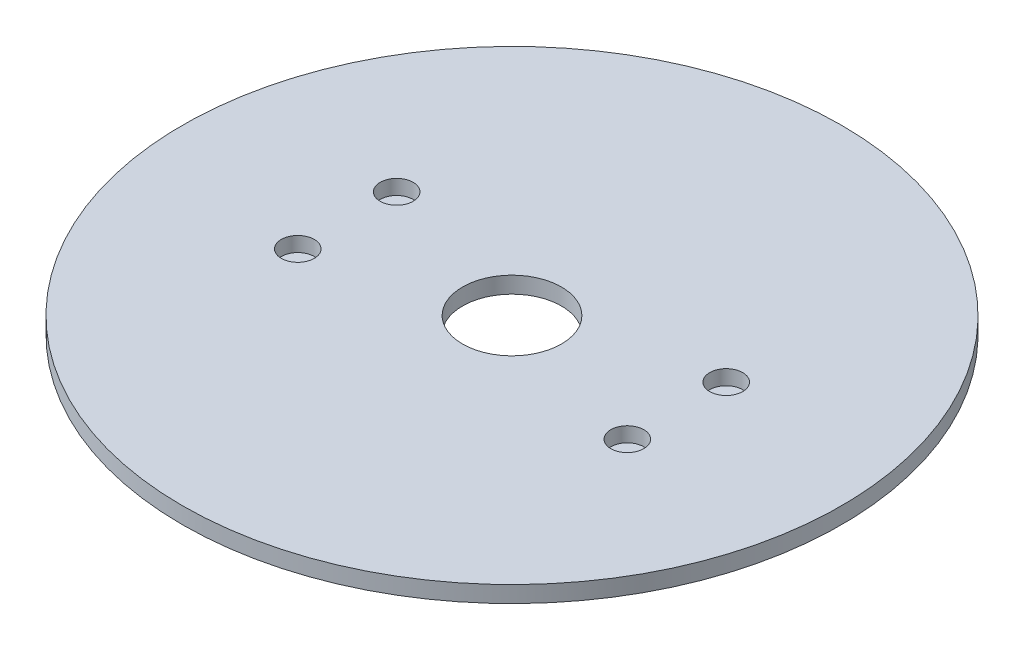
ISO-10303-21;
HEADER;
FILE_DESCRIPTION(('STEP AP214'),'2;1');
FILE_NAME('part.step','',(''),(''),'','','');
FILE_SCHEMA(('AUTOMOTIVE_DESIGN { 1 0 10303 214 1 1 1 1 }'));
ENDSEC;
DATA;
#1=APPLICATION_CONTEXT('core data for automotive mechanical design processes');
#2=APPLICATION_PROTOCOL_DEFINITION('international standard','automotive_design',2000,#1);
#3=PRODUCT_CONTEXT('',#1,'mechanical');
#4=PRODUCT('Part','Part','',(#3));
#5=PRODUCT_RELATED_PRODUCT_CATEGORY('part','',(#4));
#6=PRODUCT_DEFINITION_FORMATION('','',#4);
#7=PRODUCT_DEFINITION_CONTEXT('part definition',#1,'design');
#8=PRODUCT_DEFINITION('design','',#6,#7);
#9=PRODUCT_DEFINITION_SHAPE('','',#8);
#10=(LENGTH_UNIT() NAMED_UNIT(*) SI_UNIT(.MILLI.,.METRE.));
#11=(NAMED_UNIT(*) PLANE_ANGLE_UNIT() SI_UNIT($,.RADIAN.));
#12=(NAMED_UNIT(*) SI_UNIT($,.STERADIAN.) SOLID_ANGLE_UNIT());
#13=UNCERTAINTY_MEASURE_WITH_UNIT(LENGTH_MEASURE(1.E-05),#10,'distance_accuracy_value','');
#14=(GEOMETRIC_REPRESENTATION_CONTEXT(3) GLOBAL_UNCERTAINTY_ASSIGNED_CONTEXT((#13)) GLOBAL_UNIT_ASSIGNED_CONTEXT((#10,
#11,#12)) REPRESENTATION_CONTEXT('',''));
#15=CARTESIAN_POINT('',(0.,0.,0.));
#16=DIRECTION('',(0.,0.,1.));
#17=DIRECTION('',(1.,0.,0.));
#18=AXIS2_PLACEMENT_3D('',#15,#16,#17);
#19=CARTESIAN_POINT('',(0.,50.,0.));
#20=DIRECTION('',(0.,-1.,0.));
#21=DIRECTION('',(0.,0.,-1.));
#22=AXIS2_PLACEMENT_3D('',#19,#20,#21);
#23=CYLINDRICAL_SURFACE('',#22,1000.);
#24=CARTESIAN_POINT('',(0.,50.,0.));
#25=DIRECTION('',(0.,1.,0.));
#26=DIRECTION('',(0.,0.,1.));
#27=AXIS2_PLACEMENT_3D('',#24,#25,#26);
#28=CIRCLE('',#27,1000.);
#29=CARTESIAN_POINT('',(0.,50.,1000.));
#30=VERTEX_POINT('',#29);
#31=EDGE_CURVE('E10',#30,#30,#28,.T.);
#32=ORIENTED_EDGE('',*,*,#31,.F.);
#33=EDGE_LOOP('',(#32));
#34=FACE_BOUND('',#33,.T.);
#35=CARTESIAN_POINT('',(0.,0.,0.));
#36=DIRECTION('',(0.,1.,0.));
#37=DIRECTION('',(0.,0.,1.));
#38=AXIS2_PLACEMENT_3D('',#35,#36,#37);
#39=CIRCLE('',#38,1000.);
#40=CARTESIAN_POINT('',(0.,0.,1000.));
#41=VERTEX_POINT('',#40);
#42=EDGE_CURVE('E37',#41,#41,#39,.T.);
#43=ORIENTED_EDGE('',*,*,#42,.T.);
#44=EDGE_LOOP('',(#43));
#45=FACE_BOUND('',#44,.T.);
#46=ADVANCED_FACE('F34',(#34,#45),#23,.T.);
#47=CARTESIAN_POINT('',(0.,50.,0.));
#48=DIRECTION('',(0.,1.,0.));
#49=DIRECTION('',(0.,0.,1.));
#50=AXIS2_PLACEMENT_3D('',#47,#48,#49);
#51=PLANE('',#50);
#52=CARTESIAN_POINT('',(0.,50.,0.));
#53=DIRECTION('',(0.,1.,0.));
#54=DIRECTION('',(0.,0.,1.));
#55=AXIS2_PLACEMENT_3D('',#52,#53,#54);
#56=CIRCLE('',#55,150.);
#57=CARTESIAN_POINT('',(0.,50.,150.));
#58=VERTEX_POINT('',#57);
#59=EDGE_CURVE('E70',#58,#58,#56,.T.);
#60=ORIENTED_EDGE('',*,*,#59,.F.);
#61=EDGE_LOOP('',(#60));
#62=FACE_BOUND('',#61,.T.);
#63=CARTESIAN_POINT('',(-500.,50.,-150.));
#64=DIRECTION('',(0.,1.,0.));
#65=DIRECTION('',(0.,0.,1.));
#66=AXIS2_PLACEMENT_3D('',#63,#64,#65);
#67=CIRCLE('',#66,50.0000000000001);
#68=CARTESIAN_POINT('',(-500.,50.,-99.9999999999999));
#69=VERTEX_POINT('',#68);
#70=EDGE_CURVE('E65',#69,#69,#67,.T.);
#71=ORIENTED_EDGE('',*,*,#70,.F.);
#72=EDGE_LOOP('',(#71));
#73=FACE_BOUND('',#72,.T.);
#74=CARTESIAN_POINT('',(-500.,50.,150.));
#75=DIRECTION('',(0.,1.,0.));
#76=DIRECTION('',(0.,0.,1.));
#77=AXIS2_PLACEMENT_3D('',#74,#75,#76);
#78=CIRCLE('',#77,50.0000000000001);
#79=CARTESIAN_POINT('',(-500.,50.,200.));
#80=VERTEX_POINT('',#79);
#81=EDGE_CURVE('E58',#80,#80,#78,.T.);
#82=ORIENTED_EDGE('',*,*,#81,.F.);
#83=EDGE_LOOP('',(#82));
#84=FACE_BOUND('',#83,.T.);
#85=CARTESIAN_POINT('',(500.,50.,150.));
#86=DIRECTION('',(0.,1.,0.));
#87=DIRECTION('',(0.,0.,1.));
#88=AXIS2_PLACEMENT_3D('',#85,#86,#87);
#89=CIRCLE('',#88,50.);
#90=CARTESIAN_POINT('',(500.,50.,200.));
#91=VERTEX_POINT('',#90);
#92=EDGE_CURVE('E52',#91,#91,#89,.T.);
#93=ORIENTED_EDGE('',*,*,#92,.F.);
#94=EDGE_LOOP('',(#93));
#95=FACE_BOUND('',#94,.T.);
#96=CARTESIAN_POINT('',(500.,50.,-150.));
#97=DIRECTION('',(0.,1.,0.));
#98=DIRECTION('',(0.,0.,1.));
#99=AXIS2_PLACEMENT_3D('',#96,#97,#98);
#100=CIRCLE('',#99,50.);
#101=CARTESIAN_POINT('',(500.,50.,-100.));
#102=VERTEX_POINT('',#101);
#103=EDGE_CURVE('E46',#102,#102,#100,.T.);
#104=ORIENTED_EDGE('',*,*,#103,.F.);
#105=EDGE_LOOP('',(#104));
#106=FACE_BOUND('',#105,.T.);
#107=ORIENTED_EDGE('',*,*,#31,.T.);
#108=EDGE_LOOP('',(#107));
#109=FACE_BOUND('',#108,.T.);
#110=ADVANCED_FACE('F86',(#62,#73,#84,#95,#106,#109),#51,.T.);
#111=CARTESIAN_POINT('',(0.,0.,0.));
#112=DIRECTION('',(0.,1.,0.));
#113=DIRECTION('',(0.,0.,1.));
#114=AXIS2_PLACEMENT_3D('',#111,#112,#113);
#115=PLANE('',#114);
#116=CARTESIAN_POINT('',(0.,0.,0.));
#117=DIRECTION('',(0.,1.,0.));
#118=DIRECTION('',(0.,0.,1.));
#119=AXIS2_PLACEMENT_3D('',#116,#117,#118);
#120=CIRCLE('',#119,150.);
#121=CARTESIAN_POINT('',(0.,0.,150.));
#122=VERTEX_POINT('',#121);
#123=EDGE_CURVE('E62',#122,#122,#120,.T.);
#124=ORIENTED_EDGE('',*,*,#123,.T.);
#125=EDGE_LOOP('',(#124));
#126=FACE_BOUND('',#125,.T.);
#127=ORIENTED_EDGE('',*,*,#42,.F.);
#128=EDGE_LOOP('',(#127));
#129=FACE_BOUND('',#128,.T.);
#130=ADVANCED_FACE('F76',(#126,#129),#115,.F.);
#131=CARTESIAN_POINT('',(500.,5.,-150.));
#132=DIRECTION('',(0.,1.,0.));
#133=DIRECTION('',(0.,0.,1.));
#134=AXIS2_PLACEMENT_3D('',#131,#132,#133);
#135=CYLINDRICAL_SURFACE('',#134,50.);
#136=CARTESIAN_POINT('',(500.,5.,-150.));
#137=DIRECTION('',(0.,1.,0.));
#138=DIRECTION('',(0.,0.,1.));
#139=AXIS2_PLACEMENT_3D('',#136,#137,#138);
#140=CIRCLE('',#139,50.);
#141=CARTESIAN_POINT('',(500.,5.,-100.));
#142=VERTEX_POINT('',#141);
#143=EDGE_CURVE('E44',#142,#142,#140,.T.);
#144=CARTESIAN_POINT('',(500.,5.,-100.));
#145=CARTESIAN_POINT('',(500.,5.46875,-100.));
#146=CARTESIAN_POINT('',(500.,5.9375,-100.));
#147=CARTESIAN_POINT('',(500.,6.875,-100.));
#148=CARTESIAN_POINT('',(500.,7.34375,-100.));
#149=CARTESIAN_POINT('',(500.,8.28125,-100.));
#150=CARTESIAN_POINT('',(500.,8.75,-100.));
#151=CARTESIAN_POINT('',(500.,9.6875,-100.));
#152=CARTESIAN_POINT('',(500.,10.15625,-100.));
#153=CARTESIAN_POINT('',(500.,11.09375,-100.));
#154=CARTESIAN_POINT('',(500.,11.5625,-100.));
#155=CARTESIAN_POINT('',(500.,12.5,-100.));
#156=CARTESIAN_POINT('',(500.,12.96875,-100.));
#157=CARTESIAN_POINT('',(500.,13.90625,-100.));
#158=CARTESIAN_POINT('',(500.,14.375,-100.));
#159=CARTESIAN_POINT('',(500.,15.3125,-100.));
#160=CARTESIAN_POINT('',(500.,15.78125,-100.));
#161=CARTESIAN_POINT('',(500.,16.71875,-100.));
#162=CARTESIAN_POINT('',(500.,17.1875,-100.));
#163=CARTESIAN_POINT('',(500.,18.125,-100.));
#164=CARTESIAN_POINT('',(500.,18.59375,-100.));
#165=CARTESIAN_POINT('',(500.,19.53125,-100.));
#166=CARTESIAN_POINT('',(500.,20.,-100.));
#167=CARTESIAN_POINT('',(500.,20.9375,-100.));
#168=CARTESIAN_POINT('',(500.,21.40625,-100.));
#169=CARTESIAN_POINT('',(500.,22.34375,-100.));
#170=CARTESIAN_POINT('',(500.,22.8125,-100.));
#171=CARTESIAN_POINT('',(500.,23.75,-100.));
#172=CARTESIAN_POINT('',(500.,24.21875,-100.));
#173=CARTESIAN_POINT('',(500.,25.15625,-100.));
#174=CARTESIAN_POINT('',(500.,25.625,-100.));
#175=CARTESIAN_POINT('',(500.,26.5625,-100.));
#176=CARTESIAN_POINT('',(500.,27.03125,-100.));
#177=CARTESIAN_POINT('',(500.,27.96875,-100.));
#178=CARTESIAN_POINT('',(500.,28.4375,-100.));
#179=CARTESIAN_POINT('',(500.,29.375,-100.));
#180=CARTESIAN_POINT('',(500.,29.84375,-100.));
#181=CARTESIAN_POINT('',(500.,30.78125,-100.));
#182=CARTESIAN_POINT('',(500.,31.25,-100.));
#183=CARTESIAN_POINT('',(500.,32.1875,-100.));
#184=CARTESIAN_POINT('',(500.,32.65625,-100.));
#185=CARTESIAN_POINT('',(500.,33.59375,-100.));
#186=CARTESIAN_POINT('',(500.,34.0625,-100.));
#187=CARTESIAN_POINT('',(500.,35.,-100.));
#188=CARTESIAN_POINT('',(500.,35.46875,-100.));
#189=CARTESIAN_POINT('',(500.,36.40625,-100.));
#190=CARTESIAN_POINT('',(500.,36.875,-100.));
#191=CARTESIAN_POINT('',(500.,37.8125,-100.));
#192=CARTESIAN_POINT('',(500.,38.28125,-100.));
#193=CARTESIAN_POINT('',(500.,39.21875,-100.));
#194=CARTESIAN_POINT('',(500.,39.6875,-100.));
#195=CARTESIAN_POINT('',(500.,40.625,-100.));
#196=CARTESIAN_POINT('',(500.,41.09375,-100.));
#197=CARTESIAN_POINT('',(500.,42.03125,-100.));
#198=CARTESIAN_POINT('',(500.,42.5,-100.));
#199=CARTESIAN_POINT('',(500.,43.4375,-100.));
#200=CARTESIAN_POINT('',(500.,43.90625,-100.));
#201=CARTESIAN_POINT('',(500.,44.84375,-100.));
#202=CARTESIAN_POINT('',(500.,45.3125,-100.));
#203=CARTESIAN_POINT('',(500.,46.25,-100.));
#204=CARTESIAN_POINT('',(500.,46.71875,-100.));
#205=CARTESIAN_POINT('',(500.,47.65625,-100.));
#206=CARTESIAN_POINT('',(500.,48.125,-100.));
#207=CARTESIAN_POINT('',(500.,49.0625,-100.));
#208=CARTESIAN_POINT('',(500.,49.53125,-100.));
#209=CARTESIAN_POINT('',(500.,50.,-100.));
#210=B_SPLINE_CURVE_WITH_KNOTS('',3,(#144,#145,#146,#147,#148,#149,#150,#151,#152,#153,#154,
#155,#156,#157,#158,#159,#160,#161,#162,#163,#164,#165,#166,#167,#168,#169,#170,#171,#172,#173,
#174,#175,#176,#177,#178,#179,#180,#181,#182,#183,#184,#185,#186,#187,#188,#189,#190,#191,#192,
#193,#194,#195,#196,#197,#198,#199,#200,#201,#202,#203,#204,#205,#206,#207,#208,#209),
.UNSPECIFIED.,.F.,.F.,(4,2,2,2,2,2,2,2,2,2,2,2,2,2,2,2,2,2,2,2,2,2,2,2,2,2,2,2,2,2,2,2,4),(0.,
1.40625,2.8125,4.21875,5.625,7.03125,8.4375,9.84375,11.25,12.65625,14.0625,15.46875,16.875,
18.28125,19.6875,21.09375,22.5,23.90625,25.3125,26.71875,28.125,29.53125,30.9375,32.34375,33.75,
35.15625,36.5625,37.96875,39.375,40.78125,42.1875,43.59375,45.),.UNSPECIFIED.);
#211=EDGE_CURVE('BSEAM98',#142,#102,#210,.T.);
#212=ORIENTED_EDGE('',*,*,#143,.F.);
#213=ORIENTED_EDGE('',*,*,#103,.T.);
#214=ORIENTED_EDGE('',*,*,#211,.T.);
#215=ORIENTED_EDGE('',*,*,#211,.F.);
#216=EDGE_LOOP('',(#212,#214,#213,#215));
#217=FACE_BOUND('',#216,.T.);
#218=ADVANCED_FACE('F98',(#217),#135,.F.);
#219=CARTESIAN_POINT('',(500.,5.,-150.));
#220=DIRECTION('',(0.,1.,0.));
#221=DIRECTION('',(0.,0.,1.));
#222=AXIS2_PLACEMENT_3D('',#219,#220,#221);
#223=PLANE('',#222);
#224=ORIENTED_EDGE('',*,*,#143,.T.);
#225=EDGE_LOOP('',(#224));
#226=FACE_BOUND('',#225,.T.);
#227=ADVANCED_FACE('F100',(#226),#223,.T.);
#228=CARTESIAN_POINT('',(500.,5.,150.));
#229=DIRECTION('',(0.,1.,0.));
#230=DIRECTION('',(0.,0.,1.));
#231=AXIS2_PLACEMENT_3D('',#228,#229,#230);
#232=CYLINDRICAL_SURFACE('',#231,50.);
#233=CARTESIAN_POINT('',(500.,5.,150.));
#234=DIRECTION('',(0.,1.,0.));
#235=DIRECTION('',(0.,0.,1.));
#236=AXIS2_PLACEMENT_3D('',#233,#234,#235);
#237=CIRCLE('',#236,50.);
#238=CARTESIAN_POINT('',(500.,5.,200.));
#239=VERTEX_POINT('',#238);
#240=EDGE_CURVE('E49',#239,#239,#237,.T.);
#241=CARTESIAN_POINT('',(500.,5.,200.));
#242=CARTESIAN_POINT('',(500.,5.46875,200.));
#243=CARTESIAN_POINT('',(500.,5.9375,200.));
#244=CARTESIAN_POINT('',(500.,6.875,200.));
#245=CARTESIAN_POINT('',(500.,7.34375,200.));
#246=CARTESIAN_POINT('',(500.,8.28125,200.));
#247=CARTESIAN_POINT('',(500.,8.75,200.));
#248=CARTESIAN_POINT('',(500.,9.6875,200.));
#249=CARTESIAN_POINT('',(500.,10.15625,200.));
#250=CARTESIAN_POINT('',(500.,11.09375,200.));
#251=CARTESIAN_POINT('',(500.,11.5625,200.));
#252=CARTESIAN_POINT('',(500.,12.5,200.));
#253=CARTESIAN_POINT('',(500.,12.96875,200.));
#254=CARTESIAN_POINT('',(500.,13.90625,200.));
#255=CARTESIAN_POINT('',(500.,14.375,200.));
#256=CARTESIAN_POINT('',(500.,15.3125,200.));
#257=CARTESIAN_POINT('',(500.,15.78125,200.));
#258=CARTESIAN_POINT('',(500.,16.71875,200.));
#259=CARTESIAN_POINT('',(500.,17.1875,200.));
#260=CARTESIAN_POINT('',(500.,18.125,200.));
#261=CARTESIAN_POINT('',(500.,18.59375,200.));
#262=CARTESIAN_POINT('',(500.,19.53125,200.));
#263=CARTESIAN_POINT('',(500.,20.,200.));
#264=CARTESIAN_POINT('',(500.,20.9375,200.));
#265=CARTESIAN_POINT('',(500.,21.40625,200.));
#266=CARTESIAN_POINT('',(500.,22.34375,200.));
#267=CARTESIAN_POINT('',(500.,22.8125,200.));
#268=CARTESIAN_POINT('',(500.,23.75,200.));
#269=CARTESIAN_POINT('',(500.,24.21875,200.));
#270=CARTESIAN_POINT('',(500.,25.15625,200.));
#271=CARTESIAN_POINT('',(500.,25.625,200.));
#272=CARTESIAN_POINT('',(500.,26.5625,200.));
#273=CARTESIAN_POINT('',(500.,27.03125,200.));
#274=CARTESIAN_POINT('',(500.,27.96875,200.));
#275=CARTESIAN_POINT('',(500.,28.4375,200.));
#276=CARTESIAN_POINT('',(500.,29.375,200.));
#277=CARTESIAN_POINT('',(500.,29.84375,200.));
#278=CARTESIAN_POINT('',(500.,30.78125,200.));
#279=CARTESIAN_POINT('',(500.,31.25,200.));
#280=CARTESIAN_POINT('',(500.,32.1875,200.));
#281=CARTESIAN_POINT('',(500.,32.65625,200.));
#282=CARTESIAN_POINT('',(500.,33.59375,200.));
#283=CARTESIAN_POINT('',(500.,34.0625,200.));
#284=CARTESIAN_POINT('',(500.,35.,200.));
#285=CARTESIAN_POINT('',(500.,35.46875,200.));
#286=CARTESIAN_POINT('',(500.,36.40625,200.));
#287=CARTESIAN_POINT('',(500.,36.875,200.));
#288=CARTESIAN_POINT('',(500.,37.8125,200.));
#289=CARTESIAN_POINT('',(500.,38.28125,200.));
#290=CARTESIAN_POINT('',(500.,39.21875,200.));
#291=CARTESIAN_POINT('',(500.,39.6875,200.));
#292=CARTESIAN_POINT('',(500.,40.625,200.));
#293=CARTESIAN_POINT('',(500.,41.09375,200.));
#294=CARTESIAN_POINT('',(500.,42.03125,200.));
#295=CARTESIAN_POINT('',(500.,42.5,200.));
#296=CARTESIAN_POINT('',(500.,43.4375,200.));
#297=CARTESIAN_POINT('',(500.,43.90625,200.));
#298=CARTESIAN_POINT('',(500.,44.84375,200.));
#299=CARTESIAN_POINT('',(500.,45.3125,200.));
#300=CARTESIAN_POINT('',(500.,46.25,200.));
#301=CARTESIAN_POINT('',(500.,46.71875,200.));
#302=CARTESIAN_POINT('',(500.,47.65625,200.));
#303=CARTESIAN_POINT('',(500.,48.125,200.));
#304=CARTESIAN_POINT('',(500.,49.0625,200.));
#305=CARTESIAN_POINT('',(500.,49.53125,200.));
#306=CARTESIAN_POINT('',(500.,50.,200.));
#307=B_SPLINE_CURVE_WITH_KNOTS('',3,(#241,#242,#243,#244,#245,#246,#247,#248,#249,#250,#251,
#252,#253,#254,#255,#256,#257,#258,#259,#260,#261,#262,#263,#264,#265,#266,#267,#268,#269,#270,
#271,#272,#273,#274,#275,#276,#277,#278,#279,#280,#281,#282,#283,#284,#285,#286,#287,#288,#289,
#290,#291,#292,#293,#294,#295,#296,#297,#298,#299,#300,#301,#302,#303,#304,#305,#306),
.UNSPECIFIED.,.F.,.F.,(4,2,2,2,2,2,2,2,2,2,2,2,2,2,2,2,2,2,2,2,2,2,2,2,2,2,2,2,2,2,2,2,4),(0.,
1.40625,2.8125,4.21875,5.625,7.03125,8.4375,9.84375,11.25,12.65625,14.0625,15.46875,16.875,
18.28125,19.6875,21.09375,22.5,23.90625,25.3125,26.71875,28.125,29.53125,30.9375,32.34375,33.75,
35.15625,36.5625,37.96875,39.375,40.78125,42.1875,43.59375,45.),.UNSPECIFIED.);
#308=EDGE_CURVE('BSEAM107',#239,#91,#307,.T.);
#309=ORIENTED_EDGE('',*,*,#240,.F.);
#310=ORIENTED_EDGE('',*,*,#92,.T.);
#311=ORIENTED_EDGE('',*,*,#308,.T.);
#312=ORIENTED_EDGE('',*,*,#308,.F.);
#313=EDGE_LOOP('',(#309,#311,#310,#312));
#314=FACE_BOUND('',#313,.T.);
#315=ADVANCED_FACE('F107',(#314),#232,.F.);
#316=CARTESIAN_POINT('',(0.,5.,0.));
#317=DIRECTION('',(0.,1.,0.));
#318=DIRECTION('',(0.,0.,1.));
#319=AXIS2_PLACEMENT_3D('',#316,#317,#318);
#320=PLANE('',#319);
#321=ORIENTED_EDGE('',*,*,#240,.T.);
#322=EDGE_LOOP('',(#321));
#323=FACE_BOUND('',#322,.T.);
#324=ADVANCED_FACE('F164',(#323),#320,.T.);
#325=CARTESIAN_POINT('',(-500.,5.,150.));
#326=DIRECTION('',(0.,1.,0.));
#327=DIRECTION('',(0.,0.,1.));
#328=AXIS2_PLACEMENT_3D('',#325,#326,#327);
#329=CYLINDRICAL_SURFACE('',#328,50.0000000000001);
#330=CARTESIAN_POINT('',(-500.,5.,150.));
#331=DIRECTION('',(0.,1.,0.));
#332=DIRECTION('',(0.,0.,1.));
#333=AXIS2_PLACEMENT_3D('',#330,#331,#332);
#334=CIRCLE('',#333,50.0000000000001);
#335=CARTESIAN_POINT('',(-500.,5.,200.));
#336=VERTEX_POINT('',#335);
#337=EDGE_CURVE('E61',#336,#336,#334,.T.);
#338=CARTESIAN_POINT('',(-500.,5.,200.));
#339=CARTESIAN_POINT('',(-500.,5.46875,200.));
#340=CARTESIAN_POINT('',(-500.,5.9375,200.));
#341=CARTESIAN_POINT('',(-500.,6.875,200.));
#342=CARTESIAN_POINT('',(-500.,7.34375,200.));
#343=CARTESIAN_POINT('',(-500.,8.28125,200.));
#344=CARTESIAN_POINT('',(-500.,8.75,200.));
#345=CARTESIAN_POINT('',(-500.,9.6875,200.));
#346=CARTESIAN_POINT('',(-500.,10.15625,200.));
#347=CARTESIAN_POINT('',(-500.,11.09375,200.));
#348=CARTESIAN_POINT('',(-500.,11.5625,200.));
#349=CARTESIAN_POINT('',(-500.,12.5,200.));
#350=CARTESIAN_POINT('',(-500.,12.96875,200.));
#351=CARTESIAN_POINT('',(-500.,13.90625,200.));
#352=CARTESIAN_POINT('',(-500.,14.375,200.));
#353=CARTESIAN_POINT('',(-500.,15.3125,200.));
#354=CARTESIAN_POINT('',(-500.,15.78125,200.));
#355=CARTESIAN_POINT('',(-500.,16.71875,200.));
#356=CARTESIAN_POINT('',(-500.,17.1875,200.));
#357=CARTESIAN_POINT('',(-500.,18.125,200.));
#358=CARTESIAN_POINT('',(-500.,18.59375,200.));
#359=CARTESIAN_POINT('',(-500.,19.53125,200.));
#360=CARTESIAN_POINT('',(-500.,20.,200.));
#361=CARTESIAN_POINT('',(-500.,20.9375,200.));
#362=CARTESIAN_POINT('',(-500.,21.40625,200.));
#363=CARTESIAN_POINT('',(-500.,22.34375,200.));
#364=CARTESIAN_POINT('',(-500.,22.8125,200.));
#365=CARTESIAN_POINT('',(-500.,23.75,200.));
#366=CARTESIAN_POINT('',(-500.,24.21875,200.));
#367=CARTESIAN_POINT('',(-500.,25.15625,200.));
#368=CARTESIAN_POINT('',(-500.,25.625,200.));
#369=CARTESIAN_POINT('',(-500.,26.5625,200.));
#370=CARTESIAN_POINT('',(-500.,27.03125,200.));
#371=CARTESIAN_POINT('',(-500.,27.96875,200.));
#372=CARTESIAN_POINT('',(-500.,28.4375,200.));
#373=CARTESIAN_POINT('',(-500.,29.375,200.));
#374=CARTESIAN_POINT('',(-500.,29.84375,200.));
#375=CARTESIAN_POINT('',(-500.,30.78125,200.));
#376=CARTESIAN_POINT('',(-500.,31.25,200.));
#377=CARTESIAN_POINT('',(-500.,32.1875,200.));
#378=CARTESIAN_POINT('',(-500.,32.65625,200.));
#379=CARTESIAN_POINT('',(-500.,33.59375,200.));
#380=CARTESIAN_POINT('',(-500.,34.0625,200.));
#381=CARTESIAN_POINT('',(-500.,35.,200.));
#382=CARTESIAN_POINT('',(-500.,35.46875,200.));
#383=CARTESIAN_POINT('',(-500.,36.40625,200.));
#384=CARTESIAN_POINT('',(-500.,36.875,200.));
#385=CARTESIAN_POINT('',(-500.,37.8125,200.));
#386=CARTESIAN_POINT('',(-500.,38.28125,200.));
#387=CARTESIAN_POINT('',(-500.,39.21875,200.));
#388=CARTESIAN_POINT('',(-500.,39.6875,200.));
#389=CARTESIAN_POINT('',(-500.,40.625,200.));
#390=CARTESIAN_POINT('',(-500.,41.09375,200.));
#391=CARTESIAN_POINT('',(-500.,42.03125,200.));
#392=CARTESIAN_POINT('',(-500.,42.5,200.));
#393=CARTESIAN_POINT('',(-500.,43.4375,200.));
#394=CARTESIAN_POINT('',(-500.,43.90625,200.));
#395=CARTESIAN_POINT('',(-500.,44.84375,200.));
#396=CARTESIAN_POINT('',(-500.,45.3125,200.));
#397=CARTESIAN_POINT('',(-500.,46.25,200.));
#398=CARTESIAN_POINT('',(-500.,46.71875,200.));
#399=CARTESIAN_POINT('',(-500.,47.65625,200.));
#400=CARTESIAN_POINT('',(-500.,48.125,200.));
#401=CARTESIAN_POINT('',(-500.,49.0625,200.));
#402=CARTESIAN_POINT('',(-500.,49.53125,200.));
#403=CARTESIAN_POINT('',(-500.,50.,200.));
#404=B_SPLINE_CURVE_WITH_KNOTS('',3,(#338,#339,#340,#341,#342,#343,#344,#345,#346,#347,#348,
#349,#350,#351,#352,#353,#354,#355,#356,#357,#358,#359,#360,#361,#362,#363,#364,#365,#366,#367,
#368,#369,#370,#371,#372,#373,#374,#375,#376,#377,#378,#379,#380,#381,#382,#383,#384,#385,#386,
#387,#388,#389,#390,#391,#392,#393,#394,#395,#396,#397,#398,#399,#400,#401,#402,#403),
.UNSPECIFIED.,.F.,.F.,(4,2,2,2,2,2,2,2,2,2,2,2,2,2,2,2,2,2,2,2,2,2,2,2,2,2,2,2,2,2,2,2,4),(0.,
1.40625,2.8125,4.21875,5.625,7.03125,8.4375,9.84375,11.25,12.65625,14.0625,15.46875,16.875,
18.28125,19.6875,21.09375,22.5,23.90625,25.3125,26.71875,28.125,29.53125,30.9375,32.34375,33.75,
35.15625,36.5625,37.96875,39.375,40.78125,42.1875,43.59375,45.),.UNSPECIFIED.);
#405=EDGE_CURVE('BSEAM156',#336,#80,#404,.T.);
#406=ORIENTED_EDGE('',*,*,#337,.F.);
#407=ORIENTED_EDGE('',*,*,#81,.T.);
#408=ORIENTED_EDGE('',*,*,#405,.T.);
#409=ORIENTED_EDGE('',*,*,#405,.F.);
#410=EDGE_LOOP('',(#406,#408,#407,#409));
#411=FACE_BOUND('',#410,.T.);
#412=ADVANCED_FACE('F156',(#411),#329,.F.);
#413=CARTESIAN_POINT('',(0.,5.,0.));
#414=DIRECTION('',(0.,1.,0.));
#415=DIRECTION('',(0.,0.,1.));
#416=AXIS2_PLACEMENT_3D('',#413,#414,#415);
#417=PLANE('',#416);
#418=ORIENTED_EDGE('',*,*,#337,.T.);
#419=EDGE_LOOP('',(#418));
#420=FACE_BOUND('',#419,.T.);
#421=ADVANCED_FACE('F148',(#420),#417,.T.);
#422=CARTESIAN_POINT('',(-500.,5.,-150.));
#423=DIRECTION('',(0.,1.,0.));
#424=DIRECTION('',(0.,0.,1.));
#425=AXIS2_PLACEMENT_3D('',#422,#423,#424);
#426=CYLINDRICAL_SURFACE('',#425,50.0000000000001);
#427=CARTESIAN_POINT('',(-500.,5.,-150.));
#428=DIRECTION('',(0.,1.,0.));
#429=DIRECTION('',(0.,0.,1.));
#430=AXIS2_PLACEMENT_3D('',#427,#428,#429);
#431=CIRCLE('',#430,50.0000000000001);
#432=CARTESIAN_POINT('',(-500.,5.,-99.9999999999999));
#433=VERTEX_POINT('',#432);
#434=EDGE_CURVE('E55',#433,#433,#431,.T.);
#435=CARTESIAN_POINT('',(-500.,5.,-99.9999999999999));
#436=CARTESIAN_POINT('',(-500.,5.46875,-99.9999999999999));
#437=CARTESIAN_POINT('',(-500.,5.9375,-99.9999999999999));
#438=CARTESIAN_POINT('',(-500.,6.875,-99.9999999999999));
#439=CARTESIAN_POINT('',(-500.,7.34375,-99.9999999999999));
#440=CARTESIAN_POINT('',(-500.,8.28125,-99.9999999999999));
#441=CARTESIAN_POINT('',(-500.,8.75,-99.9999999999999));
#442=CARTESIAN_POINT('',(-500.,9.6875,-99.9999999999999));
#443=CARTESIAN_POINT('',(-500.,10.15625,-99.9999999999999));
#444=CARTESIAN_POINT('',(-500.,11.09375,-99.9999999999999));
#445=CARTESIAN_POINT('',(-500.,11.5625,-99.9999999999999));
#446=CARTESIAN_POINT('',(-500.,12.5,-99.9999999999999));
#447=CARTESIAN_POINT('',(-500.,12.96875,-99.9999999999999));
#448=CARTESIAN_POINT('',(-500.,13.90625,-99.9999999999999));
#449=CARTESIAN_POINT('',(-500.,14.375,-99.9999999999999));
#450=CARTESIAN_POINT('',(-500.,15.3125,-99.9999999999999));
#451=CARTESIAN_POINT('',(-500.,15.78125,-99.9999999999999));
#452=CARTESIAN_POINT('',(-500.,16.71875,-99.9999999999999));
#453=CARTESIAN_POINT('',(-500.,17.1875,-99.9999999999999));
#454=CARTESIAN_POINT('',(-500.,18.125,-99.9999999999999));
#455=CARTESIAN_POINT('',(-500.,18.59375,-99.9999999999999));
#456=CARTESIAN_POINT('',(-500.,19.53125,-99.9999999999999));
#457=CARTESIAN_POINT('',(-500.,20.,-99.9999999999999));
#458=CARTESIAN_POINT('',(-500.,20.9375,-99.9999999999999));
#459=CARTESIAN_POINT('',(-500.,21.40625,-99.9999999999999));
#460=CARTESIAN_POINT('',(-500.,22.34375,-99.9999999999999));
#461=CARTESIAN_POINT('',(-500.,22.8125,-99.9999999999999));
#462=CARTESIAN_POINT('',(-500.,23.75,-99.9999999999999));
#463=CARTESIAN_POINT('',(-500.,24.21875,-99.9999999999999));
#464=CARTESIAN_POINT('',(-500.,25.15625,-99.9999999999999));
#465=CARTESIAN_POINT('',(-500.,25.625,-99.9999999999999));
#466=CARTESIAN_POINT('',(-500.,26.5625,-99.9999999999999));
#467=CARTESIAN_POINT('',(-500.,27.03125,-99.9999999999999));
#468=CARTESIAN_POINT('',(-500.,27.96875,-99.9999999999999));
#469=CARTESIAN_POINT('',(-500.,28.4375,-99.9999999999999));
#470=CARTESIAN_POINT('',(-500.,29.375,-99.9999999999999));
#471=CARTESIAN_POINT('',(-500.,29.84375,-99.9999999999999));
#472=CARTESIAN_POINT('',(-500.,30.78125,-99.9999999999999));
#473=CARTESIAN_POINT('',(-500.,31.25,-99.9999999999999));
#474=CARTESIAN_POINT('',(-500.,32.1875,-99.9999999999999));
#475=CARTESIAN_POINT('',(-500.,32.65625,-99.9999999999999));
#476=CARTESIAN_POINT('',(-500.,33.59375,-99.9999999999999));
#477=CARTESIAN_POINT('',(-500.,34.0625,-99.9999999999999));
#478=CARTESIAN_POINT('',(-500.,35.,-99.9999999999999));
#479=CARTESIAN_POINT('',(-500.,35.46875,-99.9999999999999));
#480=CARTESIAN_POINT('',(-500.,36.40625,-99.9999999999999));
#481=CARTESIAN_POINT('',(-500.,36.875,-99.9999999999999));
#482=CARTESIAN_POINT('',(-500.,37.8125,-99.9999999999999));
#483=CARTESIAN_POINT('',(-500.,38.28125,-99.9999999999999));
#484=CARTESIAN_POINT('',(-500.,39.21875,-99.9999999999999));
#485=CARTESIAN_POINT('',(-500.,39.6875,-99.9999999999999));
#486=CARTESIAN_POINT('',(-500.,40.625,-99.9999999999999));
#487=CARTESIAN_POINT('',(-500.,41.09375,-99.9999999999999));
#488=CARTESIAN_POINT('',(-500.,42.03125,-99.9999999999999));
#489=CARTESIAN_POINT('',(-500.,42.5,-99.9999999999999));
#490=CARTESIAN_POINT('',(-500.,43.4375,-99.9999999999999));
#491=CARTESIAN_POINT('',(-500.,43.90625,-99.9999999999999));
#492=CARTESIAN_POINT('',(-500.,44.84375,-99.9999999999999));
#493=CARTESIAN_POINT('',(-500.,45.3125,-99.9999999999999));
#494=CARTESIAN_POINT('',(-500.,46.25,-99.9999999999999));
#495=CARTESIAN_POINT('',(-500.,46.71875,-99.9999999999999));
#496=CARTESIAN_POINT('',(-500.,47.65625,-99.9999999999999));
#497=CARTESIAN_POINT('',(-500.,48.125,-99.9999999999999));
#498=CARTESIAN_POINT('',(-500.,49.0625,-99.9999999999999));
#499=CARTESIAN_POINT('',(-500.,49.53125,-99.9999999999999));
#500=CARTESIAN_POINT('',(-500.,50.,-99.9999999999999));
#501=B_SPLINE_CURVE_WITH_KNOTS('',3,(#435,#436,#437,#438,#439,#440,#441,#442,#443,#444,#445,
#446,#447,#448,#449,#450,#451,#452,#453,#454,#455,#456,#457,#458,#459,#460,#461,#462,#463,#464,
#465,#466,#467,#468,#469,#470,#471,#472,#473,#474,#475,#476,#477,#478,#479,#480,#481,#482,#483,
#484,#485,#486,#487,#488,#489,#490,#491,#492,#493,#494,#495,#496,#497,#498,#499,#500),
.UNSPECIFIED.,.F.,.F.,(4,2,2,2,2,2,2,2,2,2,2,2,2,2,2,2,2,2,2,2,2,2,2,2,2,2,2,2,2,2,2,2,4),(0.,
1.40625,2.8125,4.21875,5.625,7.03125,8.4375,9.84375,11.25,12.65625,14.0625,15.46875,16.875,
18.28125,19.6875,21.09375,22.5,23.90625,25.3125,26.71875,28.125,29.53125,30.9375,32.34375,33.75,
35.15625,36.5625,37.96875,39.375,40.78125,42.1875,43.59375,45.),.UNSPECIFIED.);
#502=EDGE_CURVE('BSEAM141',#433,#69,#501,.T.);
#503=ORIENTED_EDGE('',*,*,#434,.F.);
#504=ORIENTED_EDGE('',*,*,#70,.T.);
#505=ORIENTED_EDGE('',*,*,#502,.T.);
#506=ORIENTED_EDGE('',*,*,#502,.F.);
#507=EDGE_LOOP('',(#503,#505,#504,#506));
#508=FACE_BOUND('',#507,.T.);
#509=ADVANCED_FACE('F141',(#508),#426,.F.);
#510=CARTESIAN_POINT('',(0.,5.,0.));
#511=DIRECTION('',(0.,1.,0.));
#512=DIRECTION('',(0.,0.,1.));
#513=AXIS2_PLACEMENT_3D('',#510,#511,#512);
#514=PLANE('',#513);
#515=ORIENTED_EDGE('',*,*,#434,.T.);
#516=EDGE_LOOP('',(#515));
#517=FACE_BOUND('',#516,.T.);
#518=ADVANCED_FACE('F82',(#517),#514,.T.);
#519=CARTESIAN_POINT('',(0.,0.,0.));
#520=DIRECTION('',(0.,1.,0.));
#521=DIRECTION('',(0.,0.,1.));
#522=AXIS2_PLACEMENT_3D('',#519,#520,#521);
#523=CYLINDRICAL_SURFACE('',#522,150.);
#524=ORIENTED_EDGE('',*,*,#123,.F.);
#525=EDGE_LOOP('',(#524));
#526=FACE_BOUND('',#525,.T.);
#527=ORIENTED_EDGE('',*,*,#59,.T.);
#528=EDGE_LOOP('',(#527));
#529=FACE_BOUND('',#528,.T.);
#530=ADVANCED_FACE('F79',(#526,#529),#523,.F.);
#531=CLOSED_SHELL('',(#46,#110,#130,#218,#227,#315,#324,#412,#421,#509,#518,#530));
#532=MANIFOLD_SOLID_BREP('B2',#531);
#533=ADVANCED_BREP_SHAPE_REPRESENTATION('',(#18,#532),#14);
#534=SHAPE_DEFINITION_REPRESENTATION(#9,#533);
ENDSEC;
END-ISO-10303-21;
